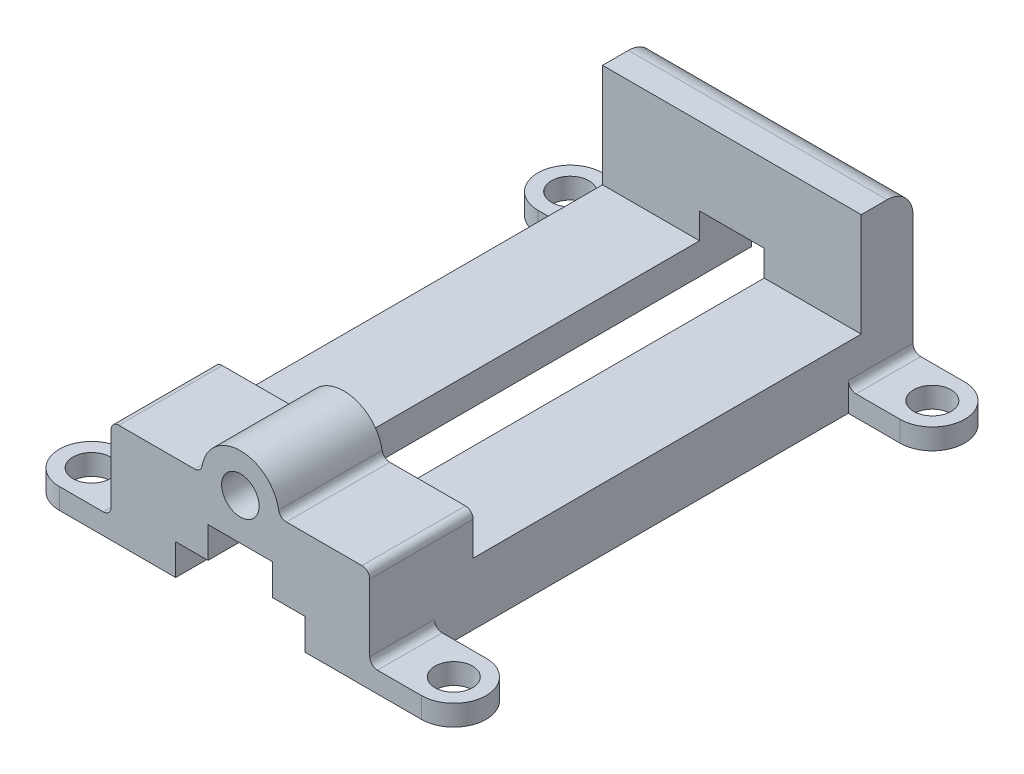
from build123d import *

# Parameters (mm, degrees)
EXTRUDE1_DEPTH             = 210
CUT_EXTRUDE1_REACH         = 241.008
SKETCH2_W                  = 150
SKETCH2_H                  = 31
SKETCH4_W                  = 100
SKETCH4_H                  = 40
EXTRUDE2_DEPTH             = 20
CUT_EXTRUDE2_REACH         = 208.63
SKETCH5_W                  = 25
SKETCH5_H                  = 10
FILLET1_R                  = 10
M16X1_5_TAPPED_HOLE1_D     = 14.5
M16X1_5_TAPPED_HOLE1_DEPTH = 36.5
M16X1_5_TAPPED_HOLE1_TIP   = 4.356239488
EXTRUDE3_DEPTH             = 8
M16X1_5_TAPPED_HOLE2_D     = 14.5
FILLET2_R                  = 3


with BuildPart() as part:
    # Sketch1 → Extrude1 (new body)
    with BuildSketch(Plane.XY):
        with BuildLine():
            Line((-25, 0), (-50, 0))
            Line((-50, 0), (-50, 40))
            Line((-50, 40), (-15, 40))
            ThreePointArc((-15, 40), (0, 55), (15, 40))
            Line((15, 40), (50, 40))
            Line((50, 40), (50, 0))
            Line((50, 0), (25, 0))
            Line((25, 0), (25, 12))
            Line((25, 12), (12.5, 12))
            Line((12.5, 12), (12.5, 24))
            Line((12.5, 24), (-12.5, 24))
            Line((-12.5, 24), (-12.5, 12))
            Line((-12.5, 12), (-25, 12))
            Line((-25, 12), (-25, 0))
        make_face()
    extrude(amount=-EXTRUDE1_DEPTH)

    # Sketch2 → Cut-Extrude1 (cut, up to next)
    with BuildSketch(Plane(origin=(50, 0, 0), x_dir=(0, 0, -1), z_dir=(1, 0, 0)), mode=Mode.PRIVATE) as cut_extrude1_sk1:
        with Locations((115, 39.5)):
            Rectangle(SKETCH2_W, SKETCH2_H)
    cut_extrude1_tool1 = extrude(cut_extrude1_sk1.sketch, amount=-CUT_EXTRUDE1_REACH, mode=Mode.PRIVATE) & part.part
    add(cut_extrude1_tool1.solids().sort_by_distance((50, 39.5, -115))[0], mode=Mode.SUBTRACT)

    # Sketch4 → Extrude2 (add)
    with BuildSketch(Plane.XY.offset(-190)):
        with Locations((0, 44)):
            Rectangle(SKETCH4_W, SKETCH4_H)
    extrude(amount=-EXTRUDE2_DEPTH)

    # Sketch5 → Cut-Extrude2 (cut, up to next)
    with BuildSketch(Plane.XY.offset(-190), mode=Mode.PRIVATE) as cut_extrude2_sk1:
        with Locations((0, 29)):
            Rectangle(SKETCH5_W, SKETCH5_H)
    cut_extrude2_tool1 = extrude(cut_extrude2_sk1.sketch, amount=-CUT_EXTRUDE2_REACH, mode=Mode.PRIVATE) & part.part
    add(cut_extrude2_tool1.solids().sort_by_distance((0, 29, -190))[0], mode=Mode.SUBTRACT)

    # Fillet1
    fillet1_edges = [part.edges().sort_by_distance(p)[0] for p in [
        (0, 64, -210),
    ]]
    fillet(fillet1_edges, radius=FILLET1_R)

    # M16x1.5 Tapped Hole1
    with Locations(Plane.XY):
        with Locations((0, 40)):
            Hole(M16X1_5_TAPPED_HOLE1_D / 2, depth=M16X1_5_TAPPED_HOLE1_DEPTH)
            with Locations((0, 0, -(M16X1_5_TAPPED_HOLE1_DEPTH + M16X1_5_TAPPED_HOLE1_TIP / 2))):  # 118° drill point
                Cone(0, M16X1_5_TAPPED_HOLE1_D / 2, M16X1_5_TAPPED_HOLE1_TIP, mode=Mode.SUBTRACT)

    # Sketch8 → Extrude3 (add)
    with BuildSketch(Plane(origin=(0, 0, 0), x_dir=(1, 0, 0), z_dir=(0, 1, 0))):
        with BuildLine():
            Line((50, 0), (70, 0))
            ThreePointArc((70, 0), (82.5, 12.5), (70, 25))
            Line((70, 25), (50, 25))
            Line((50, 25), (50, 0))
        make_face()
        with BuildLine():
            Line((50, 185), (50, 210))
            Line((50, 210), (70, 210))
            ThreePointArc((70, 210), (82.5, 197.5), (70, 185))
            Line((70, 185), (50, 185))
        make_face()
        with BuildLine():
            Line((-50, 25), (-50, 0))
            Line((-50, 0), (-70, 0))
            ThreePointArc((-70, 0), (-82.5, 12.5), (-70, 25))
            Line((-70, 25), (-50, 25))
        make_face()
        with BuildLine():
            Line((-50, 210), (-70, 210))
            ThreePointArc((-70, 210), (-82.5, 197.5), (-70, 185))
            Line((-70, 185), (-50, 185))
            Line((-50, 185), (-50, 210))
        make_face()
    extrude(amount=EXTRUDE3_DEPTH)

    # M16x1.5 Tapped Hole2 (through all)
    with Locations(Plane(origin=(0, 8, 0), x_dir=(-1, 0, 0), z_dir=(0, 1, 0))):
        with Locations((-70, -12.5), (-70, -197.5), (70, -197.5), (70, -12.5)):
            Hole(M16X1_5_TAPPED_HOLE2_D / 2)

    # Fillet2
    fillet2_edges = [part.edges().sort_by_distance(p)[0] for p in [
        (-50, 8, -197.5),
        (-50, 8, -12.5),
        (-15, 40, -20),
        (15, 40, -20),
        (50, 8, -197.5),
        (50, 8, -12.5),
        (50, 40, -20),
        (-50, 40, -20),
    ]]
    fillet(fillet2_edges, radius=FILLET2_R)


solid = part.part
